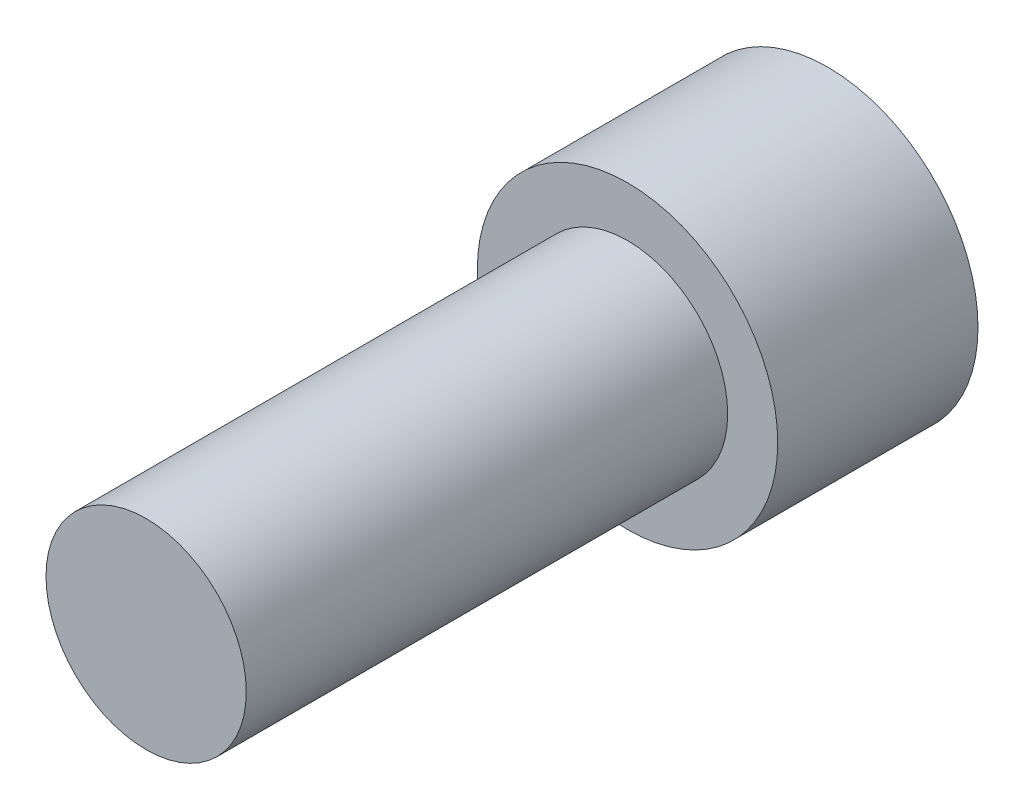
ISO-10303-21;
HEADER;
FILE_DESCRIPTION(('STEP AP214'),'2;1');
FILE_NAME('part.step','',(''),(''),'','','');
FILE_SCHEMA(('AUTOMOTIVE_DESIGN { 1 0 10303 214 1 1 1 1 }'));
ENDSEC;
DATA;
#1=APPLICATION_CONTEXT('core data for automotive mechanical design processes');
#2=APPLICATION_PROTOCOL_DEFINITION('international standard','automotive_design',2000,#1);
#3=PRODUCT_CONTEXT('',#1,'mechanical');
#4=PRODUCT('Part','Part','',(#3));
#5=PRODUCT_RELATED_PRODUCT_CATEGORY('part','',(#4));
#6=PRODUCT_DEFINITION_FORMATION('','',#4);
#7=PRODUCT_DEFINITION_CONTEXT('part definition',#1,'design');
#8=PRODUCT_DEFINITION('design','',#6,#7);
#9=PRODUCT_DEFINITION_SHAPE('','',#8);
#10=(LENGTH_UNIT() NAMED_UNIT(*) SI_UNIT(.MILLI.,.METRE.));
#11=(NAMED_UNIT(*) PLANE_ANGLE_UNIT() SI_UNIT($,.RADIAN.));
#12=(NAMED_UNIT(*) SI_UNIT($,.STERADIAN.) SOLID_ANGLE_UNIT());
#13=UNCERTAINTY_MEASURE_WITH_UNIT(LENGTH_MEASURE(1.E-05),#10,'distance_accuracy_value','');
#14=(GEOMETRIC_REPRESENTATION_CONTEXT(3) GLOBAL_UNCERTAINTY_ASSIGNED_CONTEXT((#13)) GLOBAL_UNIT_ASSIGNED_CONTEXT((#10,
#11,#12)) REPRESENTATION_CONTEXT('',''));
#15=CARTESIAN_POINT('',(0.,0.,0.));
#16=DIRECTION('',(0.,0.,1.));
#17=DIRECTION('',(1.,0.,0.));
#18=AXIS2_PLACEMENT_3D('',#15,#16,#17);
#19=CARTESIAN_POINT('',(0.,0.,19.05));
#20=DIRECTION('',(0.,0.,1.));
#21=DIRECTION('',(1.,0.,0.));
#22=AXIS2_PLACEMENT_3D('',#19,#20,#21);
#23=PLANE('',#22);
#24=CARTESIAN_POINT('',(0.,0.,19.05));
#25=DIRECTION('',(0.,0.,1.));
#26=DIRECTION('',(1.,0.,0.));
#27=AXIS2_PLACEMENT_3D('',#24,#25,#26);
#28=CIRCLE('',#27,3.9624);
#29=CARTESIAN_POINT('',(3.9624,0.,19.05));
#30=VERTEX_POINT('',#29);
#31=EDGE_CURVE('E11',#30,#30,#28,.T.);
#32=ORIENTED_EDGE('',*,*,#31,.T.);
#33=EDGE_LOOP('',(#32));
#34=FACE_BOUND('',#33,.T.);
#35=ADVANCED_FACE('F33',(#34),#23,.T.);
#36=CARTESIAN_POINT('',(0.,0.,19.05));
#37=DIRECTION('',(0.,0.,1.));
#38=DIRECTION('',(1.,0.,0.));
#39=AXIS2_PLACEMENT_3D('',#36,#37,#38);
#40=CYLINDRICAL_SURFACE('',#39,3.9624);
#41=CARTESIAN_POINT('',(0.,0.,0.));
#42=DIRECTION('',(0.,0.,1.));
#43=DIRECTION('',(1.,0.,0.));
#44=AXIS2_PLACEMENT_3D('',#41,#42,#43);
#45=CIRCLE('',#44,3.9624);
#46=CARTESIAN_POINT('',(3.9624,0.,0.));
#47=VERTEX_POINT('',#46);
#48=EDGE_CURVE('E40',#47,#47,#45,.T.);
#49=ORIENTED_EDGE('',*,*,#48,.T.);
#50=EDGE_LOOP('',(#49));
#51=FACE_BOUND('',#50,.T.);
#52=ORIENTED_EDGE('',*,*,#31,.F.);
#53=EDGE_LOOP('',(#52));
#54=FACE_BOUND('',#53,.T.);
#55=ADVANCED_FACE('F147',(#51,#54),#40,.T.);
#56=CARTESIAN_POINT('',(0.,-3.9624,0.));
#57=DIRECTION('',(0.,0.,1.));
#58=DIRECTION('',(1.,0.,0.));
#59=AXIS2_PLACEMENT_3D('',#56,#57,#58);
#60=PLANE('',#59);
#61=CARTESIAN_POINT('',(0.,0.,0.));
#62=DIRECTION('',(0.,0.,1.));
#63=DIRECTION('',(1.,0.,0.));
#64=AXIS2_PLACEMENT_3D('',#61,#62,#63);
#65=CIRCLE('',#64,5.9436);
#66=CARTESIAN_POINT('',(5.9436,0.,0.));
#67=VERTEX_POINT('',#66);
#68=EDGE_CURVE('E142',#67,#67,#65,.T.);
#69=ORIENTED_EDGE('',*,*,#68,.T.);
#70=EDGE_LOOP('',(#69));
#71=FACE_BOUND('',#70,.T.);
#72=ORIENTED_EDGE('',*,*,#48,.F.);
#73=EDGE_LOOP('',(#72));
#74=FACE_BOUND('',#73,.T.);
#75=ADVANCED_FACE('F150',(#71,#74),#60,.T.);
#76=CARTESIAN_POINT('',(0.,0.,19.05));
#77=DIRECTION('',(0.,0.,1.));
#78=DIRECTION('',(1.,0.,0.));
#79=AXIS2_PLACEMENT_3D('',#76,#77,#78);
#80=CYLINDRICAL_SURFACE('',#79,5.9436);
#81=CARTESIAN_POINT('',(0.,0.,-7.9248));
#82=DIRECTION('',(0.,0.,1.));
#83=DIRECTION('',(1.,0.,0.));
#84=AXIS2_PLACEMENT_3D('',#81,#82,#83);
#85=CIRCLE('',#84,5.9436);
#86=CARTESIAN_POINT('',(5.9436,0.,-7.9248));
#87=VERTEX_POINT('',#86);
#88=EDGE_CURVE('E134',#87,#87,#85,.T.);
#89=ORIENTED_EDGE('',*,*,#88,.T.);
#90=EDGE_LOOP('',(#89));
#91=FACE_BOUND('',#90,.T.);
#92=ORIENTED_EDGE('',*,*,#68,.F.);
#93=EDGE_LOOP('',(#92));
#94=FACE_BOUND('',#93,.T.);
#95=ADVANCED_FACE('F152',(#91,#94),#80,.T.);
#96=CARTESIAN_POINT('',(0.,-5.9436,-7.9248));
#97=DIRECTION('',(0.,0.,-1.));
#98=DIRECTION('',(-1.,0.,0.));
#99=AXIS2_PLACEMENT_3D('',#96,#97,#98);
#100=PLANE('',#99);
#101=DIRECTION('',(0.866025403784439,-0.5,0.));
#102=VECTOR('',#101,1.);
#103=CARTESIAN_POINT('',(0.,3.66617420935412,-7.9248));
#104=LINE('',#103,#102);
#105=CARTESIAN_POINT('',(0.,3.66617420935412,-7.9248));
#106=VERTEX_POINT('',#105);
#107=CARTESIAN_POINT('',(3.175,1.83308710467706,-7.9248));
#108=VERTEX_POINT('',#107);
#109=EDGE_CURVE('E47',#106,#108,#104,.T.);
#110=ORIENTED_EDGE('',*,*,#109,.F.);
#111=DIRECTION('',(0.866025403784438,0.5,0.));
#112=VECTOR('',#111,1.);
#113=CARTESIAN_POINT('',(-3.175,1.83308710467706,-7.9248));
#114=LINE('',#113,#112);
#115=CARTESIAN_POINT('',(-3.175,1.83308710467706,-7.9248));
#116=VERTEX_POINT('',#115);
#117=EDGE_CURVE('E130',#116,#106,#114,.T.);
#118=ORIENTED_EDGE('',*,*,#117,.F.);
#119=DIRECTION('',(0.,1.,0.));
#120=VECTOR('',#119,1.);
#121=CARTESIAN_POINT('',(-3.175,-1.83308710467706,-7.9248));
#122=LINE('',#121,#120);
#123=CARTESIAN_POINT('',(-3.175,-1.83308710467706,-7.9248));
#124=VERTEX_POINT('',#123);
#125=EDGE_CURVE('E128',#124,#116,#122,.T.);
#126=ORIENTED_EDGE('',*,*,#125,.F.);
#127=DIRECTION('',(-0.866025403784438,0.5,0.));
#128=VECTOR('',#127,1.);
#129=CARTESIAN_POINT('',(0.,-3.66617420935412,-7.9248));
#130=LINE('',#129,#128);
#131=CARTESIAN_POINT('',(0.,-3.66617420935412,-7.9248));
#132=VERTEX_POINT('',#131);
#133=EDGE_CURVE('E95',#132,#124,#130,.T.);
#134=ORIENTED_EDGE('',*,*,#133,.F.);
#135=DIRECTION('',(-0.866025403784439,-0.5,0.));
#136=VECTOR('',#135,1.);
#137=CARTESIAN_POINT('',(3.175,-1.83308710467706,-7.9248));
#138=LINE('',#137,#136);
#139=CARTESIAN_POINT('',(3.175,-1.83308710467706,-7.9248));
#140=VERTEX_POINT('',#139);
#141=EDGE_CURVE('E124',#140,#132,#138,.T.);
#142=ORIENTED_EDGE('',*,*,#141,.F.);
#143=DIRECTION('',(0.,-1.,0.));
#144=VECTOR('',#143,1.);
#145=CARTESIAN_POINT('',(3.175,1.83308710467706,-7.9248));
#146=LINE('',#145,#144);
#147=EDGE_CURVE('E121',#108,#140,#146,.T.);
#148=ORIENTED_EDGE('',*,*,#147,.F.);
#149=EDGE_LOOP('',(#110,#118,#126,#134,#142,#148));
#150=FACE_BOUND('',#149,.T.);
#151=ORIENTED_EDGE('',*,*,#88,.F.);
#152=EDGE_LOOP('',(#151));
#153=FACE_BOUND('',#152,.T.);
#154=ADVANCED_FACE('F159',(#150,#153),#100,.T.);
#155=CARTESIAN_POINT('',(0.,3.66617420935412,-3.0988));
#156=DIRECTION('',(0.5,0.866025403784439,0.));
#157=DIRECTION('',(-0.866025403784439,0.5,0.));
#158=AXIS2_PLACEMENT_3D('',#155,#156,#157);
#159=PLANE('',#158);
#160=ORIENTED_EDGE('',*,*,#109,.T.);
#161=DIRECTION('',(0.,0.,-1.));
#162=VECTOR('',#161,1.);
#163=CARTESIAN_POINT('',(3.175,1.83308710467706,-3.0988));
#164=LINE('',#163,#162);
#165=CARTESIAN_POINT('',(3.175,1.83308710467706,-3.0988));
#166=VERTEX_POINT('',#165);
#167=EDGE_CURVE('E77',#166,#108,#164,.T.);
#168=ORIENTED_EDGE('',*,*,#167,.F.);
#169=DIRECTION('',(0.866025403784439,-0.5,0.));
#170=VECTOR('',#169,1.);
#171=CARTESIAN_POINT('',(0.,3.66617420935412,-3.0988));
#172=LINE('',#171,#170);
#173=CARTESIAN_POINT('',(0.,3.66617420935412,-3.0988));
#174=VERTEX_POINT('',#173);
#175=EDGE_CURVE('E132',#174,#166,#172,.T.);
#176=ORIENTED_EDGE('',*,*,#175,.F.);
#177=DIRECTION('',(0.,0.,-1.));
#178=VECTOR('',#177,1.);
#179=CARTESIAN_POINT('',(0.,3.66617420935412,-3.0988));
#180=LINE('',#179,#178);
#181=EDGE_CURVE('E55',#174,#106,#180,.T.);
#182=ORIENTED_EDGE('',*,*,#181,.T.);
#183=EDGE_LOOP('',(#160,#168,#176,#182));
#184=FACE_BOUND('',#183,.T.);
#185=ADVANCED_FACE('F190',(#184),#159,.F.);
#186=CARTESIAN_POINT('',(-3.175,1.83308710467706,-3.0988));
#187=DIRECTION('',(-0.5,0.866025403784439,0.));
#188=DIRECTION('',(-0.866025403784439,-0.5,0.));
#189=AXIS2_PLACEMENT_3D('',#186,#187,#188);
#190=PLANE('',#189);
#191=ORIENTED_EDGE('',*,*,#117,.T.);
#192=ORIENTED_EDGE('',*,*,#181,.F.);
#193=DIRECTION('',(0.866025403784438,0.5,0.));
#194=VECTOR('',#193,1.);
#195=CARTESIAN_POINT('',(-3.175,1.83308710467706,-3.0988));
#196=LINE('',#195,#194);
#197=CARTESIAN_POINT('',(-3.175,1.83308710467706,-3.0988));
#198=VERTEX_POINT('',#197);
#199=EDGE_CURVE('E107',#198,#174,#196,.T.);
#200=ORIENTED_EDGE('',*,*,#199,.F.);
#201=DIRECTION('',(0.,0.,-1.));
#202=VECTOR('',#201,1.);
#203=CARTESIAN_POINT('',(-3.175,1.83308710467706,-3.0988));
#204=LINE('',#203,#202);
#205=EDGE_CURVE('E99',#198,#116,#204,.T.);
#206=ORIENTED_EDGE('',*,*,#205,.T.);
#207=EDGE_LOOP('',(#191,#192,#200,#206));
#208=FACE_BOUND('',#207,.T.);
#209=ADVANCED_FACE('F200',(#208),#190,.F.);
#210=CARTESIAN_POINT('',(-3.175,-1.83308710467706,-3.0988));
#211=DIRECTION('',(-1.,0.,0.));
#212=DIRECTION('',(0.,-1.,0.));
#213=AXIS2_PLACEMENT_3D('',#210,#211,#212);
#214=PLANE('',#213);
#215=ORIENTED_EDGE('',*,*,#125,.T.);
#216=ORIENTED_EDGE('',*,*,#205,.F.);
#217=DIRECTION('',(0.,1.,0.));
#218=VECTOR('',#217,1.);
#219=CARTESIAN_POINT('',(-3.175,-1.83308710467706,-3.0988));
#220=LINE('',#219,#218);
#221=CARTESIAN_POINT('',(-3.175,-1.83308710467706,-3.0988));
#222=VERTEX_POINT('',#221);
#223=EDGE_CURVE('E103',#222,#198,#220,.T.);
#224=ORIENTED_EDGE('',*,*,#223,.F.);
#225=DIRECTION('',(0.,0.,-1.));
#226=VECTOR('',#225,1.);
#227=CARTESIAN_POINT('',(-3.175,-1.83308710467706,-3.0988));
#228=LINE('',#227,#226);
#229=EDGE_CURVE('E88',#222,#124,#228,.T.);
#230=ORIENTED_EDGE('',*,*,#229,.T.);
#231=EDGE_LOOP('',(#215,#216,#224,#230));
#232=FACE_BOUND('',#231,.T.);
#233=ADVANCED_FACE('F104',(#232),#214,.F.);
#234=CARTESIAN_POINT('',(0.,-3.66617420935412,-3.0988));
#235=DIRECTION('',(-0.5,-0.866025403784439,0.));
#236=DIRECTION('',(0.866025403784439,-0.5,0.));
#237=AXIS2_PLACEMENT_3D('',#234,#235,#236);
#238=PLANE('',#237);
#239=ORIENTED_EDGE('',*,*,#133,.T.);
#240=ORIENTED_EDGE('',*,*,#229,.F.);
#241=DIRECTION('',(-0.866025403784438,0.5,0.));
#242=VECTOR('',#241,1.);
#243=CARTESIAN_POINT('',(0.,-3.66617420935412,-3.0988));
#244=LINE('',#243,#242);
#245=CARTESIAN_POINT('',(0.,-3.66617420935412,-3.0988));
#246=VERTEX_POINT('',#245);
#247=EDGE_CURVE('E92',#246,#222,#244,.T.);
#248=ORIENTED_EDGE('',*,*,#247,.F.);
#249=DIRECTION('',(0.,0.,-1.));
#250=VECTOR('',#249,1.);
#251=CARTESIAN_POINT('',(0.,-3.66617420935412,-3.0988));
#252=LINE('',#251,#250);
#253=EDGE_CURVE('E100',#246,#132,#252,.T.);
#254=ORIENTED_EDGE('',*,*,#253,.T.);
#255=EDGE_LOOP('',(#239,#240,#248,#254));
#256=FACE_BOUND('',#255,.T.);
#257=ADVANCED_FACE('F90',(#256),#238,.F.);
#258=CARTESIAN_POINT('',(3.175,-1.83308710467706,-3.0988));
#259=DIRECTION('',(0.5,-0.866025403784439,0.));
#260=DIRECTION('',(0.866025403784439,0.5,0.));
#261=AXIS2_PLACEMENT_3D('',#258,#259,#260);
#262=PLANE('',#261);
#263=ORIENTED_EDGE('',*,*,#141,.T.);
#264=ORIENTED_EDGE('',*,*,#253,.F.);
#265=DIRECTION('',(-0.866025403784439,-0.5,0.));
#266=VECTOR('',#265,1.);
#267=CARTESIAN_POINT('',(3.175,-1.83308710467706,-3.0988));
#268=LINE('',#267,#266);
#269=CARTESIAN_POINT('',(3.175,-1.83308710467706,-3.0988));
#270=VERTEX_POINT('',#269);
#271=EDGE_CURVE('E113',#270,#246,#268,.T.);
#272=ORIENTED_EDGE('',*,*,#271,.F.);
#273=DIRECTION('',(0.,0.,-1.));
#274=VECTOR('',#273,1.);
#275=CARTESIAN_POINT('',(3.175,-1.83308710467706,-3.0988));
#276=LINE('',#275,#274);
#277=EDGE_CURVE('E137',#270,#140,#276,.T.);
#278=ORIENTED_EDGE('',*,*,#277,.T.);
#279=EDGE_LOOP('',(#263,#264,#272,#278));
#280=FACE_BOUND('',#279,.T.);
#281=ADVANCED_FACE('F225',(#280),#262,.F.);
#282=CARTESIAN_POINT('',(3.175,1.83308710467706,-3.0988));
#283=DIRECTION('',(1.,0.,0.));
#284=DIRECTION('',(0.,0.,-1.));
#285=AXIS2_PLACEMENT_3D('',#282,#283,#284);
#286=PLANE('',#285);
#287=ORIENTED_EDGE('',*,*,#147,.T.);
#288=ORIENTED_EDGE('',*,*,#277,.F.);
#289=DIRECTION('',(0.,-1.,0.));
#290=VECTOR('',#289,1.);
#291=CARTESIAN_POINT('',(3.175,1.83308710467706,-3.0988));
#292=LINE('',#291,#290);
#293=EDGE_CURVE('E115',#166,#270,#292,.T.);
#294=ORIENTED_EDGE('',*,*,#293,.F.);
#295=ORIENTED_EDGE('',*,*,#167,.T.);
#296=EDGE_LOOP('',(#287,#288,#294,#295));
#297=FACE_BOUND('',#296,.T.);
#298=ADVANCED_FACE('F234',(#297),#286,.F.);
#299=CARTESIAN_POINT('',(0.,3.66617420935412,-3.0988));
#300=DIRECTION('',(0.,0.,1.));
#301=DIRECTION('',(1.,0.,0.));
#302=AXIS2_PLACEMENT_3D('',#299,#300,#301);
#303=PLANE('',#302);
#304=ORIENTED_EDGE('',*,*,#175,.T.);
#305=ORIENTED_EDGE('',*,*,#293,.T.);
#306=ORIENTED_EDGE('',*,*,#271,.T.);
#307=ORIENTED_EDGE('',*,*,#247,.T.);
#308=ORIENTED_EDGE('',*,*,#223,.T.);
#309=ORIENTED_EDGE('',*,*,#199,.T.);
#310=EDGE_LOOP('',(#304,#305,#306,#307,#308,#309));
#311=FACE_BOUND('',#310,.T.);
#312=ADVANCED_FACE('F110',(#311),#303,.F.);
#313=CLOSED_SHELL('',(#35,#55,#75,#95,#154,#185,#209,#233,#257,#281,#298,#312));
#314=MANIFOLD_SOLID_BREP('B2',#313);
#315=ADVANCED_BREP_SHAPE_REPRESENTATION('',(#18,#314),#14);
#316=SHAPE_DEFINITION_REPRESENTATION(#9,#315);
ENDSEC;
END-ISO-10303-21;
